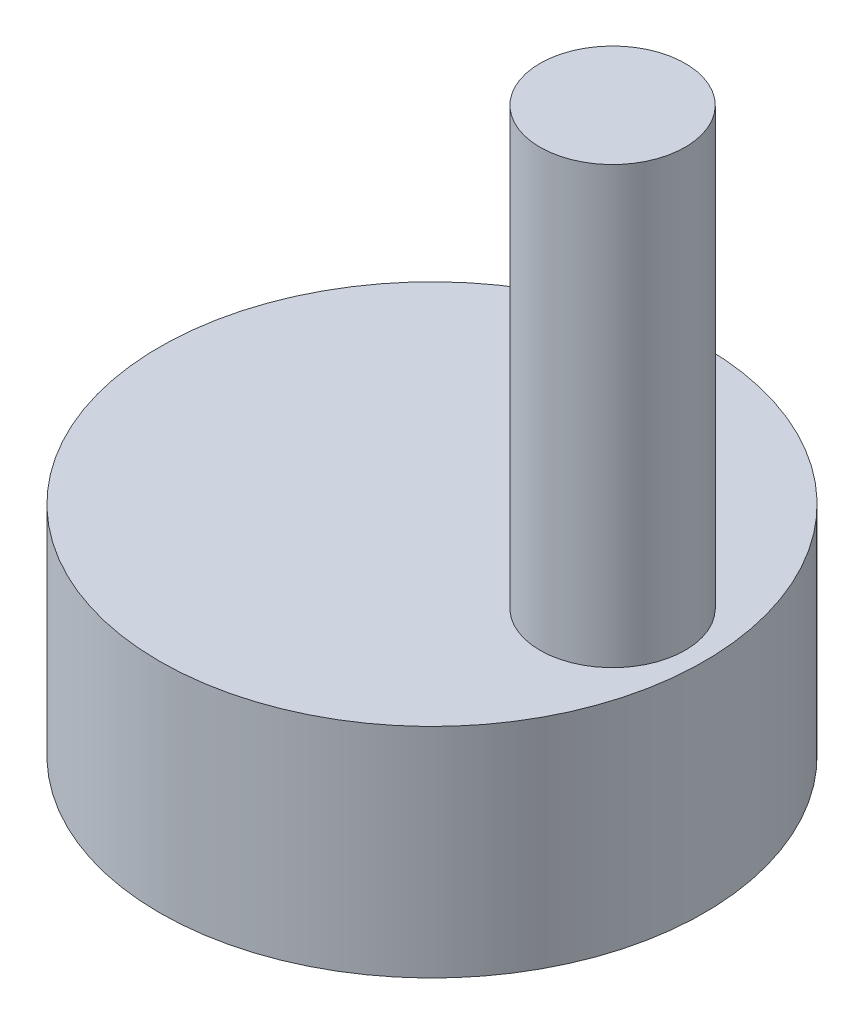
from build123d import *

# Parameters (mm, degrees)
SKETCH1_R           = 3.75
BOSS_EXTRUDE1_DEPTH = 3
SKETCH2_R           = 1
BOSS_EXTRUDE2_DEPTH = 6


with BuildPart() as part:
    # Sketch1 → Boss-Extrude1 (new body)
    with BuildSketch(Plane(origin=(0, 0, 0), x_dir=(1, 0, 0), z_dir=(0, 1, 0))):
        with Locations(Location((0, 0, 0), (0, 0, 270))):
            Circle(SKETCH1_R)
    extrude(amount=BOSS_EXTRUDE1_DEPTH)

    # Sketch2 → Boss-Extrude2 (add)
    with BuildSketch(Plane(origin=(0, 3, 0), x_dir=(1, 0, 0), z_dir=(0, 1, 0))):
        with Locations(Location((2.4868, 0, 0), (0, 0, 270))):
            Circle(SKETCH2_R)
    extrude(amount=BOSS_EXTRUDE2_DEPTH)


solid = part.part
